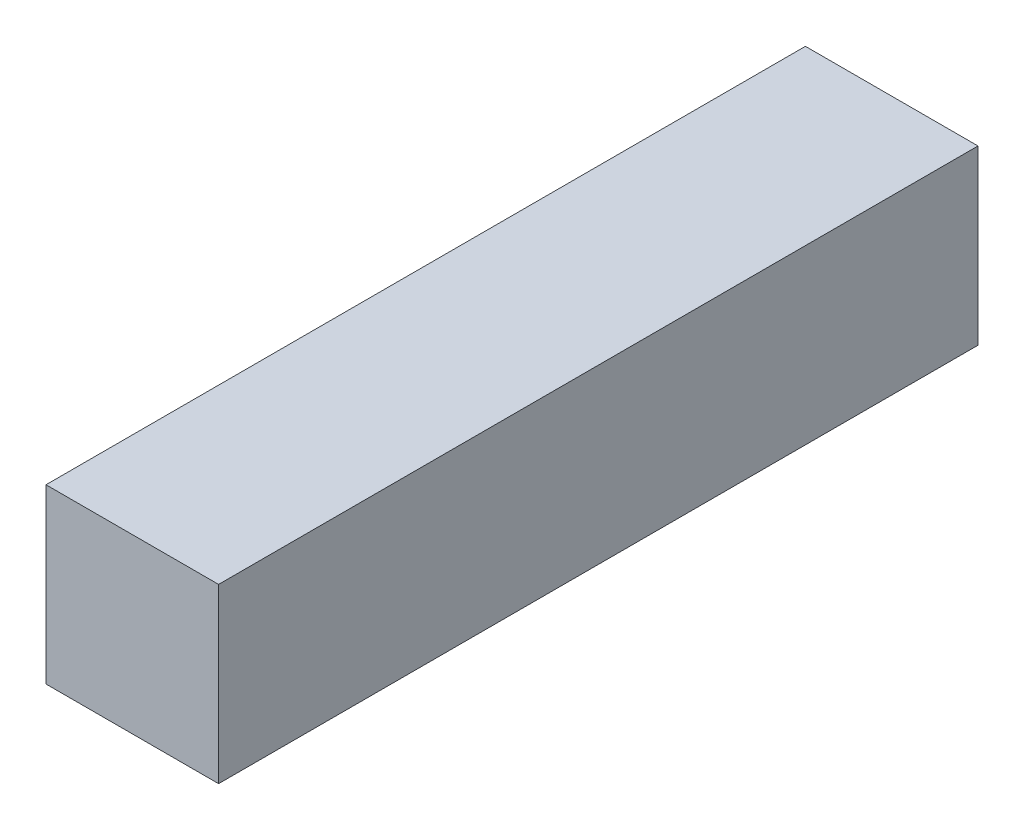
from build123d import *

# Parameters (mm, degrees)
ESQUISSE1_W      = 10
ESQUISSE1_H      = 10
EXTRUSION1_DEPTH = 44


with BuildPart() as part:
    # Esquisse1 → Extrusion1 (new body)
    with BuildSketch(Plane.XY):
        with Locations((5, 5)):
            Rectangle(ESQUISSE1_W, ESQUISSE1_H)
    extrude(amount=EXTRUSION1_DEPTH)


solid = part.part
